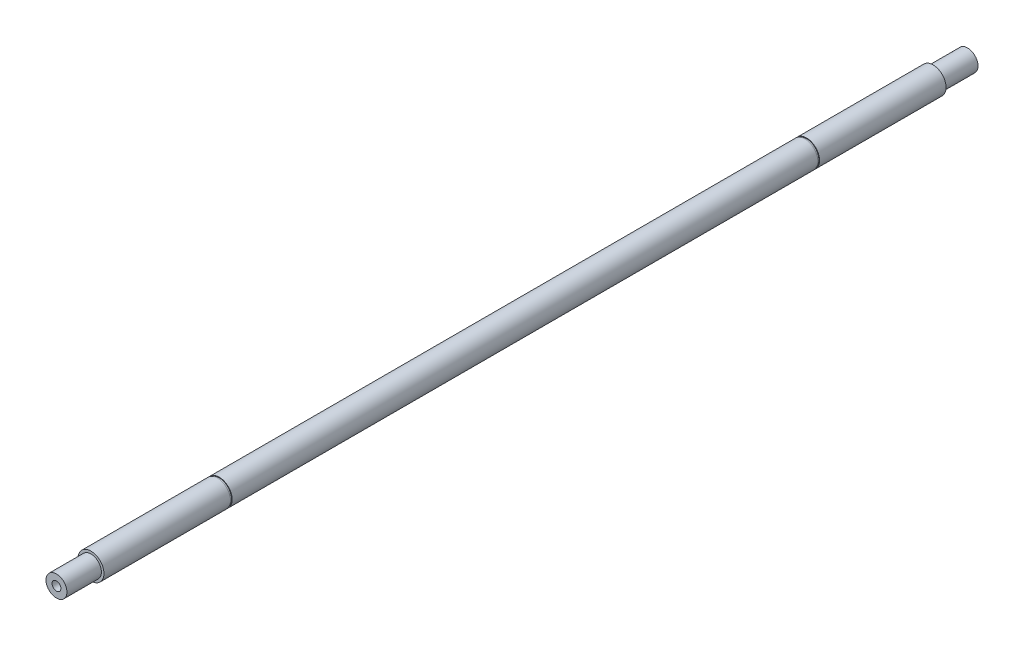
from build123d import *

# Parameters (mm, degrees)
ESQUISSE1_R                = 10
EXTRUSION1_DEPTH           = 350
ESQUISSE2_OUTSIDE_W        = 162.114
ESQUISSE2_OUTSIDE_H        = 162.114
ESQUISSE2_OUTSIDE_R        = 8.05
ENL_V_MAT_EXTRU_1_DEPTH    = 26.5
ESQUISSE3_OUTSIDE_W        = 162.114
ESQUISSE3_OUTSIDE_H        = 162.114
ESQUISSE3_OUTSIDE_R        = 8.05
ENL_V_MAT_EXTRU_2_DEPTH    = 26.5
ESQUISSE5_W                = 2.5
ESQUISSE5_H                = 1.3
ESQUISSE7_W                = 2.5
ESQUISSE7_H                = 1.3
TROU_TARAUD_M8X1_251_D     = 6.8
TROU_TARAUD_M8X1_251_DEPTH = 20
TROU_TARAUD_M8X1_251_TIP   = 2.042926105
TROU_TARAUD_M8X1_252_D     = 6.8
TROU_TARAUD_M8X1_252_DEPTH = 20
TROU_TARAUD_M8X1_252_TIP   = 2.042926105


with BuildPart() as part:
    # Esquisse1 → Extrusion1 (new, symmetric)
    with BuildSketch(Plane.XY):
        Circle(ESQUISSE1_R)
    extrude(amount=EXTRUSION1_DEPTH, both=True)

    # Esquisse2 outside → Enl_v. mat.-Extru.1 (cut)
    with BuildSketch(Plane.XY.offset(350)):
        Rectangle(ESQUISSE2_OUTSIDE_W, ESQUISSE2_OUTSIDE_H)
        Circle(ESQUISSE2_OUTSIDE_R, mode=Mode.SUBTRACT)
    extrude(amount=-ENL_V_MAT_EXTRU_1_DEPTH, mode=Mode.SUBTRACT)

    # Esquisse3 outside → Enl_v. mat.-Extru.2 (cut)
    with BuildSketch(Plane(origin=(0, 0, -350), x_dir=(-1, 0, 0), z_dir=(0, 0, -1))):
        Rectangle(ESQUISSE3_OUTSIDE_W, ESQUISSE3_OUTSIDE_H)
        with Locations(Location((0, 0, 0), (0, 0, 180))):
            Circle(ESQUISSE3_OUTSIDE_R, mode=Mode.SUBTRACT)
    extrude(amount=-ENL_V_MAT_EXTRU_2_DEPTH, mode=Mode.SUBTRACT)

    # Esquisse5 → Gorge pour DIN 471 - 20 x 1.2_ Circlips (revolve, cut)
    with BuildSketch(Plane(origin=(0, 0, 350), x_dir=(0, 1, 0), z_dir=(-1, 0, 0)), mode=Mode.PRIVATE) as gorge_pour_din_471_20_x_1_2_circlips_sk:
        with Locations((10.75, 124.35)):
            Rectangle(ESQUISSE5_W, ESQUISSE5_H)
    revolve(gorge_pour_din_471_20_x_1_2_circlips_sk.sketch.rotate(Axis((0, 0, 400), (0, 0, -1)), 270), axis=Axis((0, 0, 400), (0, 0, -1)), mode=Mode.SUBTRACT)

    # Esquisse7 → Gorge pour DIN 471 - 20 x 1.2_ Circl 2 (revolve, cut)
    with BuildSketch(Plane(origin=(0, 0, 350), x_dir=(0, 1, 0), z_dir=(-1, 0, 0)), mode=Mode.PRIVATE) as gorge_pour_din_471_20_x_1_2_circl_2_sk:
        with Locations((10.75, 575.65)):
            Rectangle(ESQUISSE7_W, ESQUISSE7_H)
    revolve(gorge_pour_din_471_20_x_1_2_circl_2_sk.sketch.rotate(Axis((0, 0, 400), (0, 0, -1)), 270), axis=Axis((0, 0, 400), (0, 0, -1)), mode=Mode.SUBTRACT)

    # Trou taraud_ M8x1.251
    with Locations(Plane.XY.offset(350)):
        with Locations((0, 0)):
            Hole(TROU_TARAUD_M8X1_251_D / 2, depth=TROU_TARAUD_M8X1_251_DEPTH)
            with Locations((0, 0, -(TROU_TARAUD_M8X1_251_DEPTH + TROU_TARAUD_M8X1_251_TIP / 2))):  # 118° drill point
                Cone(0, TROU_TARAUD_M8X1_251_D / 2, TROU_TARAUD_M8X1_251_TIP, mode=Mode.SUBTRACT)

    # Trou taraud_ M8x1.252
    with Locations(Plane(origin=(0, 0, -350), x_dir=(-1, 0, 0), z_dir=(0, 0, -1))):
        with Locations((0, 0)):
            Hole(TROU_TARAUD_M8X1_252_D / 2, depth=TROU_TARAUD_M8X1_252_DEPTH)
            with Locations((0, 0, -(TROU_TARAUD_M8X1_252_DEPTH + TROU_TARAUD_M8X1_252_TIP / 2))):  # 118° drill point
                Cone(0, TROU_TARAUD_M8X1_252_D / 2, TROU_TARAUD_M8X1_252_TIP, mode=Mode.SUBTRACT)


solid = part.part
